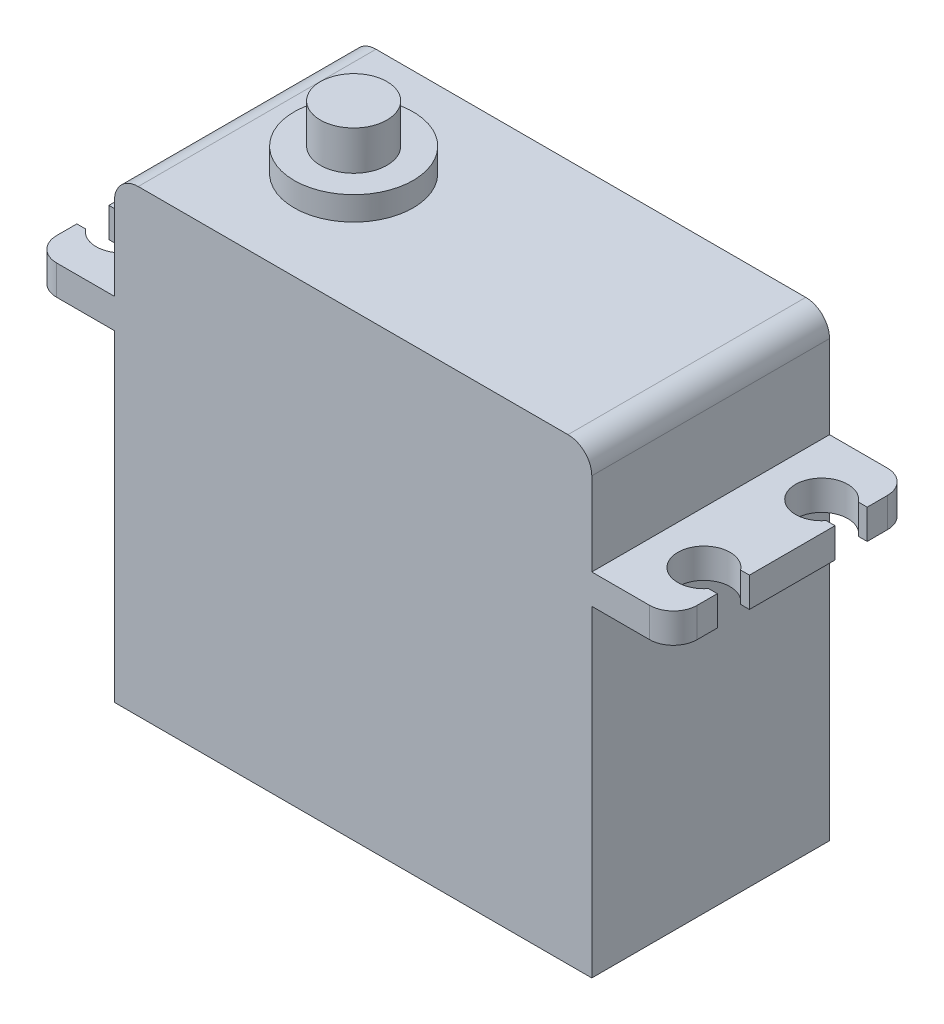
ISO-10303-21;
HEADER;
FILE_DESCRIPTION(('STEP AP214'),'2;1');
FILE_NAME('part.step','',(''),(''),'','','');
FILE_SCHEMA(('AUTOMOTIVE_DESIGN { 1 0 10303 214 1 1 1 1 }'));
ENDSEC;
DATA;
#1=APPLICATION_CONTEXT('core data for automotive mechanical design processes');
#2=APPLICATION_PROTOCOL_DEFINITION('international standard','automotive_design',2000,#1);
#3=PRODUCT_CONTEXT('',#1,'mechanical');
#4=PRODUCT('Part','Part','',(#3));
#5=PRODUCT_RELATED_PRODUCT_CATEGORY('part','',(#4));
#6=PRODUCT_DEFINITION_FORMATION('','',#4);
#7=PRODUCT_DEFINITION_CONTEXT('part definition',#1,'design');
#8=PRODUCT_DEFINITION('design','',#6,#7);
#9=PRODUCT_DEFINITION_SHAPE('','',#8);
#10=(LENGTH_UNIT() NAMED_UNIT(*) SI_UNIT(.MILLI.,.METRE.));
#11=(NAMED_UNIT(*) PLANE_ANGLE_UNIT() SI_UNIT($,.RADIAN.));
#12=(NAMED_UNIT(*) SI_UNIT($,.STERADIAN.) SOLID_ANGLE_UNIT());
#13=UNCERTAINTY_MEASURE_WITH_UNIT(LENGTH_MEASURE(1.E-05),#10,'distance_accuracy_value','');
#14=(GEOMETRIC_REPRESENTATION_CONTEXT(3) GLOBAL_UNCERTAINTY_ASSIGNED_CONTEXT((#13)) GLOBAL_UNIT_ASSIGNED_CONTEXT((#10,
#11,#12)) REPRESENTATION_CONTEXT('',''));
#15=CARTESIAN_POINT('',(0.,0.,0.));
#16=DIRECTION('',(0.,0.,1.));
#17=DIRECTION('',(1.,0.,0.));
#18=AXIS2_PLACEMENT_3D('',#15,#16,#17);
#19=CARTESIAN_POINT('',(20.066,40.5638,9.9949));
#20=DIRECTION('',(-1.,0.,0.));
#21=DIRECTION('',(0.,0.,1.));
#22=AXIS2_PLACEMENT_3D('',#19,#20,#21);
#23=PLANE('',#22);
#24=DIRECTION('',(0.,-1.,0.));
#25=VECTOR('',#24,1.);
#26=CARTESIAN_POINT('',(20.066,40.5638,-9.9949));
#27=LINE('',#26,#25);
#28=CARTESIAN_POINT('',(20.066,36.5638,-9.9949));
#29=VERTEX_POINT('',#28);
#30=CARTESIAN_POINT('',(20.066,29.5656,-9.9949));
#31=VERTEX_POINT('',#30);
#32=EDGE_CURVE('E439',#29,#31,#27,.T.);
#33=ORIENTED_EDGE('',*,*,#32,.F.);
#34=DIRECTION('',(0.,0.,-1.));
#35=VECTOR('',#34,1.);
#36=CARTESIAN_POINT('',(20.066,36.5638,9.9949));
#37=LINE('',#36,#35);
#38=CARTESIAN_POINT('',(20.066,36.5638,9.9949));
#39=VERTEX_POINT('',#38);
#40=EDGE_CURVE('E471',#29,#39,#37,.F.);
#41=ORIENTED_EDGE('',*,*,#40,.T.);
#42=DIRECTION('',(0.,-1.,0.));
#43=VECTOR('',#42,1.);
#44=CARTESIAN_POINT('',(20.066,40.5638,9.9949));
#45=LINE('',#44,#43);
#46=CARTESIAN_POINT('',(20.066,29.5656,9.9949));
#47=VERTEX_POINT('',#46);
#48=EDGE_CURVE('E429',#39,#47,#45,.T.);
#49=ORIENTED_EDGE('',*,*,#48,.T.);
#50=DIRECTION('',(0.,0.,1.));
#51=VECTOR('',#50,1.);
#52=CARTESIAN_POINT('',(20.066,29.5656,-9.9949));
#53=LINE('',#52,#51);
#54=EDGE_CURVE('E393',#31,#47,#53,.T.);
#55=ORIENTED_EDGE('',*,*,#54,.F.);
#56=EDGE_LOOP('',(#33,#41,#49,#55));
#57=FACE_BOUND('',#56,.T.);
#58=ADVANCED_FACE('F36',(#57),#23,.F.);
#59=CARTESIAN_POINT('',(-20.066,40.5638,-9.9949));
#60=DIRECTION('',(0.,0.,1.));
#61=DIRECTION('',(1.,0.,0.));
#62=AXIS2_PLACEMENT_3D('',#59,#60,#61);
#63=PLANE('',#62);
#64=DIRECTION('',(0.,-1.,0.));
#65=VECTOR('',#64,1.);
#66=CARTESIAN_POINT('',(-20.066,40.5638,-9.9949));
#67=LINE('',#66,#65);
#68=CARTESIAN_POINT('',(-20.066,36.5638,-9.9949));
#69=VERTEX_POINT('',#68);
#70=CARTESIAN_POINT('',(-20.066,29.5656,-9.9949));
#71=VERTEX_POINT('',#70);
#72=EDGE_CURVE('E435',#69,#71,#67,.T.);
#73=ORIENTED_EDGE('',*,*,#72,.F.);
#74=CARTESIAN_POINT('',(-18.066,36.5638,-9.9949));
#75=DIRECTION('',(0.,0.,1.));
#76=DIRECTION('',(1.,0.,0.));
#77=AXIS2_PLACEMENT_3D('',#74,#75,#76);
#78=CIRCLE('',#77,2.);
#79=CARTESIAN_POINT('',(-18.066,38.5638,-9.9949));
#80=VERTEX_POINT('',#79);
#81=EDGE_CURVE('E469',#69,#80,#78,.F.);
#82=ORIENTED_EDGE('',*,*,#81,.T.);
#83=DIRECTION('',(-1.,0.,0.));
#84=VECTOR('',#83,1.);
#85=CARTESIAN_POINT('',(0.,38.5638,-9.9949));
#86=LINE('',#85,#84);
#87=CARTESIAN_POINT('',(18.066,38.5638,-9.9949));
#88=VERTEX_POINT('',#87);
#89=EDGE_CURVE('E627',#88,#80,#86,.T.);
#90=ORIENTED_EDGE('',*,*,#89,.F.);
#91=CARTESIAN_POINT('',(18.066,36.5638,-9.9949));
#92=DIRECTION('',(0.,0.,1.));
#93=DIRECTION('',(1.,0.,0.));
#94=AXIS2_PLACEMENT_3D('',#91,#92,#93);
#95=CIRCLE('',#94,2.);
#96=EDGE_CURVE('E467',#88,#29,#95,.F.);
#97=ORIENTED_EDGE('',*,*,#96,.T.);
#98=ORIENTED_EDGE('',*,*,#32,.T.);
#99=DIRECTION('',(-1.,0.,0.));
#100=VECTOR('',#99,1.);
#101=CARTESIAN_POINT('',(20.066,29.5656,-9.9949));
#102=LINE('',#101,#100);
#103=CARTESIAN_POINT('',(24.924,29.5656,-9.9949));
#104=VERTEX_POINT('',#103);
#105=EDGE_CURVE('E398',#104,#31,#102,.T.);
#106=ORIENTED_EDGE('',*,*,#105,.F.);
#107=DIRECTION('',(0.,1.,0.));
#108=VECTOR('',#107,1.);
#109=CARTESIAN_POINT('',(24.924,27.0656,-9.9949));
#110=LINE('',#109,#108);
#111=CARTESIAN_POINT('',(24.924,27.0656,-9.9949));
#112=VERTEX_POINT('',#111);
#113=EDGE_CURVE('E462',#104,#112,#110,.F.);
#114=ORIENTED_EDGE('',*,*,#113,.T.);
#115=DIRECTION('',(-1.,0.,0.));
#116=VECTOR('',#115,1.);
#117=CARTESIAN_POINT('',(20.066,27.0656,-9.9949));
#118=LINE('',#117,#116);
#119=CARTESIAN_POINT('',(20.066,27.0656,-9.9949));
#120=VERTEX_POINT('',#119);
#121=EDGE_CURVE('E404',#112,#120,#118,.T.);
#122=ORIENTED_EDGE('',*,*,#121,.T.);
#123=CARTESIAN_POINT('',(20.066,0.,-9.9949));
#124=VERTEX_POINT('',#123);
#125=EDGE_CURVE('E438',#120,#124,#27,.T.);
#126=ORIENTED_EDGE('',*,*,#125,.T.);
#127=DIRECTION('',(-1.,0.,0.));
#128=VECTOR('',#127,1.);
#129=CARTESIAN_POINT('',(-20.066,0.,-9.9949));
#130=LINE('',#129,#128);
#131=CARTESIAN_POINT('',(-20.066,0.,-9.9949));
#132=VERTEX_POINT('',#131);
#133=EDGE_CURVE('E419',#124,#132,#130,.T.);
#134=ORIENTED_EDGE('',*,*,#133,.T.);
#135=CARTESIAN_POINT('',(-20.066,27.0656,-9.9949));
#136=VERTEX_POINT('',#135);
#137=EDGE_CURVE('E434',#136,#132,#67,.T.);
#138=ORIENTED_EDGE('',*,*,#137,.F.);
#139=DIRECTION('',(1.,0.,0.));
#140=VECTOR('',#139,1.);
#141=CARTESIAN_POINT('',(-20.066,27.0656,-9.9949));
#142=LINE('',#141,#140);
#143=CARTESIAN_POINT('',(-24.924,27.0656,-9.9949));
#144=VERTEX_POINT('',#143);
#145=EDGE_CURVE('E322',#144,#136,#142,.T.);
#146=ORIENTED_EDGE('',*,*,#145,.F.);
#147=DIRECTION('',(0.,1.,0.));
#148=VECTOR('',#147,1.);
#149=CARTESIAN_POINT('',(-24.924,40.5638,-9.9949));
#150=LINE('',#149,#148);
#151=CARTESIAN_POINT('',(-24.924,29.5656,-9.9949));
#152=VERTEX_POINT('',#151);
#153=EDGE_CURVE('E464',#144,#152,#150,.T.);
#154=ORIENTED_EDGE('',*,*,#153,.T.);
#155=DIRECTION('',(1.,0.,0.));
#156=VECTOR('',#155,1.);
#157=CARTESIAN_POINT('',(-20.066,29.5656,-9.9949));
#158=LINE('',#157,#156);
#159=EDGE_CURVE('E335',#152,#71,#158,.T.);
#160=ORIENTED_EDGE('',*,*,#159,.T.);
#161=EDGE_LOOP('',(#73,#82,#90,#97,#98,#106,#114,#122,#126,#134,#138,#146,#154,#160));
#162=FACE_BOUND('',#161,.T.);
#163=ADVANCED_FACE('F515',(#162),#63,.F.);
#164=CARTESIAN_POINT('',(-20.066,40.5638,9.9949));
#165=DIRECTION('',(1.,0.,0.));
#166=DIRECTION('',(0.,0.,-1.));
#167=AXIS2_PLACEMENT_3D('',#164,#165,#166);
#168=PLANE('',#167);
#169=DIRECTION('',(0.,-1.,0.));
#170=VECTOR('',#169,1.);
#171=CARTESIAN_POINT('',(-20.066,40.5638,9.9949));
#172=LINE('',#171,#170);
#173=CARTESIAN_POINT('',(-20.066,36.5638,9.9949));
#174=VERTEX_POINT('',#173);
#175=CARTESIAN_POINT('',(-20.066,29.5656,9.9949));
#176=VERTEX_POINT('',#175);
#177=EDGE_CURVE('E432',#174,#176,#172,.T.);
#178=ORIENTED_EDGE('',*,*,#177,.F.);
#179=DIRECTION('',(0.,0.,1.));
#180=VECTOR('',#179,1.);
#181=CARTESIAN_POINT('',(-20.066,36.5638,-9.9949));
#182=LINE('',#181,#180);
#183=EDGE_CURVE('E460',#174,#69,#182,.F.);
#184=ORIENTED_EDGE('',*,*,#183,.T.);
#185=ORIENTED_EDGE('',*,*,#72,.T.);
#186=DIRECTION('',(0.,0.,1.));
#187=VECTOR('',#186,1.);
#188=CARTESIAN_POINT('',(-20.066,29.5656,-9.9949));
#189=LINE('',#188,#187);
#190=EDGE_CURVE('E318',#71,#176,#189,.T.);
#191=ORIENTED_EDGE('',*,*,#190,.T.);
#192=EDGE_LOOP('',(#178,#184,#185,#191));
#193=FACE_BOUND('',#192,.T.);
#194=ADVANCED_FACE('F576',(#193),#168,.F.);
#195=CARTESIAN_POINT('',(-20.066,40.5638,9.9949));
#196=DIRECTION('',(0.,0.,-1.));
#197=DIRECTION('',(-1.,0.,0.));
#198=AXIS2_PLACEMENT_3D('',#195,#196,#197);
#199=PLANE('',#198);
#200=DIRECTION('',(1.,0.,0.));
#201=VECTOR('',#200,1.);
#202=CARTESIAN_POINT('',(0.,38.5638,9.9949));
#203=LINE('',#202,#201);
#204=CARTESIAN_POINT('',(-18.066,38.5638,9.9949));
#205=VERTEX_POINT('',#204);
#206=CARTESIAN_POINT('',(18.066,38.5638,9.9949));
#207=VERTEX_POINT('',#206);
#208=EDGE_CURVE('E634',#205,#207,#203,.T.);
#209=ORIENTED_EDGE('',*,*,#208,.F.);
#210=CARTESIAN_POINT('',(-18.066,36.5638,9.9949));
#211=DIRECTION('',(0.,0.,-1.));
#212=DIRECTION('',(-1.,0.,0.));
#213=AXIS2_PLACEMENT_3D('',#210,#211,#212);
#214=CIRCLE('',#213,2.);
#215=EDGE_CURVE('E458',#205,#174,#214,.F.);
#216=ORIENTED_EDGE('',*,*,#215,.T.);
#217=ORIENTED_EDGE('',*,*,#177,.T.);
#218=DIRECTION('',(-1.,0.,0.));
#219=VECTOR('',#218,1.);
#220=CARTESIAN_POINT('',(-20.066,29.5656,9.9949));
#221=LINE('',#220,#219);
#222=CARTESIAN_POINT('',(-24.924,29.5656,9.9949));
#223=VERTEX_POINT('',#222);
#224=EDGE_CURVE('E323',#176,#223,#221,.T.);
#225=ORIENTED_EDGE('',*,*,#224,.T.);
#226=DIRECTION('',(0.,1.,0.));
#227=VECTOR('',#226,1.);
#228=CARTESIAN_POINT('',(-24.924,40.5638,9.9949));
#229=LINE('',#228,#227);
#230=CARTESIAN_POINT('',(-24.924,27.0656,9.9949));
#231=VERTEX_POINT('',#230);
#232=EDGE_CURVE('E454',#223,#231,#229,.F.);
#233=ORIENTED_EDGE('',*,*,#232,.T.);
#234=DIRECTION('',(-1.,0.,0.));
#235=VECTOR('',#234,1.);
#236=CARTESIAN_POINT('',(-20.066,27.0656,9.9949));
#237=LINE('',#236,#235);
#238=CARTESIAN_POINT('',(-20.066,27.0656,9.9949));
#239=VERTEX_POINT('',#238);
#240=EDGE_CURVE('E328',#239,#231,#237,.T.);
#241=ORIENTED_EDGE('',*,*,#240,.F.);
#242=CARTESIAN_POINT('',(-20.066,0.,9.9949));
#243=VERTEX_POINT('',#242);
#244=EDGE_CURVE('E431',#239,#243,#172,.T.);
#245=ORIENTED_EDGE('',*,*,#244,.T.);
#246=DIRECTION('',(1.,0.,0.));
#247=VECTOR('',#246,1.);
#248=CARTESIAN_POINT('',(-20.066,0.,9.9949));
#249=LINE('',#248,#247);
#250=CARTESIAN_POINT('',(20.066,0.,9.9949));
#251=VERTEX_POINT('',#250);
#252=EDGE_CURVE('E425',#243,#251,#249,.T.);
#253=ORIENTED_EDGE('',*,*,#252,.T.);
#254=CARTESIAN_POINT('',(20.066,27.0656,9.9949));
#255=VERTEX_POINT('',#254);
#256=EDGE_CURVE('E428',#255,#251,#45,.T.);
#257=ORIENTED_EDGE('',*,*,#256,.F.);
#258=DIRECTION('',(1.,0.,0.));
#259=VECTOR('',#258,1.);
#260=CARTESIAN_POINT('',(20.066,27.0656,9.9949));
#261=LINE('',#260,#259);
#262=CARTESIAN_POINT('',(24.924,27.0656,9.9949));
#263=VERTEX_POINT('',#262);
#264=EDGE_CURVE('E397',#255,#263,#261,.T.);
#265=ORIENTED_EDGE('',*,*,#264,.T.);
#266=DIRECTION('',(0.,1.,0.));
#267=VECTOR('',#266,1.);
#268=CARTESIAN_POINT('',(24.924,29.5656,9.9949));
#269=LINE('',#268,#267);
#270=CARTESIAN_POINT('',(24.924,29.5656,9.9949));
#271=VERTEX_POINT('',#270);
#272=EDGE_CURVE('E451',#263,#271,#269,.T.);
#273=ORIENTED_EDGE('',*,*,#272,.T.);
#274=DIRECTION('',(1.,0.,0.));
#275=VECTOR('',#274,1.);
#276=CARTESIAN_POINT('',(20.066,29.5656,9.9949));
#277=LINE('',#276,#275);
#278=EDGE_CURVE('E410',#47,#271,#277,.T.);
#279=ORIENTED_EDGE('',*,*,#278,.F.);
#280=ORIENTED_EDGE('',*,*,#48,.F.);
#281=CARTESIAN_POINT('',(18.066,36.5638,9.9949));
#282=DIRECTION('',(0.,0.,-1.));
#283=DIRECTION('',(-1.,0.,0.));
#284=AXIS2_PLACEMENT_3D('',#281,#282,#283);
#285=CIRCLE('',#284,2.);
#286=EDGE_CURVE('E456',#39,#207,#285,.F.);
#287=ORIENTED_EDGE('',*,*,#286,.T.);
#288=EDGE_LOOP('',(#209,#216,#217,#225,#233,#241,#245,#253,#257,#265,#273,#279,#280,#287));
#289=FACE_BOUND('',#288,.T.);
#290=ADVANCED_FACE('F525',(#289),#199,.F.);
#291=CARTESIAN_POINT('',(-26.924,27.0656,-9.9949));
#292=DIRECTION('',(1.,0.,0.));
#293=DIRECTION('',(0.,0.,-1.));
#294=AXIS2_PLACEMENT_3D('',#291,#292,#293);
#295=PLANE('',#294);
#296=DIRECTION('',(0.,0.,-1.));
#297=VECTOR('',#296,1.);
#298=CARTESIAN_POINT('',(-26.924,29.5656,-9.9949));
#299=LINE('',#298,#297);
#300=CARTESIAN_POINT('',(-26.924,29.5656,-6.3));
#301=VERTEX_POINT('',#300);
#302=CARTESIAN_POINT('',(-26.924,29.5656,-7.9949));
#303=VERTEX_POINT('',#302);
#304=EDGE_CURVE('E281',#301,#303,#299,.T.);
#305=ORIENTED_EDGE('',*,*,#304,.T.);
#306=DIRECTION('',(0.,1.,0.));
#307=VECTOR('',#306,1.);
#308=CARTESIAN_POINT('',(-26.924,27.0656,-7.9949));
#309=LINE('',#308,#307);
#310=CARTESIAN_POINT('',(-26.924,27.0656,-7.9949));
#311=VERTEX_POINT('',#310);
#312=EDGE_CURVE('E477',#303,#311,#309,.F.);
#313=ORIENTED_EDGE('',*,*,#312,.T.);
#314=DIRECTION('',(0.,0.,-1.));
#315=VECTOR('',#314,1.);
#316=CARTESIAN_POINT('',(-26.924,27.0656,-9.9949));
#317=LINE('',#316,#315);
#318=CARTESIAN_POINT('',(-26.924,27.0656,-6.3));
#319=VERTEX_POINT('',#318);
#320=EDGE_CURVE('E325',#319,#311,#317,.T.);
#321=ORIENTED_EDGE('',*,*,#320,.F.);
#322=DIRECTION('',(0.,1.,0.));
#323=VECTOR('',#322,1.);
#324=CARTESIAN_POINT('',(-26.924,20.6463885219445,-6.3));
#325=LINE('',#324,#323);
#326=EDGE_CURVE('E264',#319,#301,#325,.T.);
#327=ORIENTED_EDGE('',*,*,#326,.T.);
#328=EDGE_LOOP('',(#305,#313,#321,#327));
#329=FACE_BOUND('',#328,.T.);
#330=ADVANCED_FACE('F608',(#329),#295,.F.);
#331=DIRECTION('',(0.,1.,0.));
#332=VECTOR('',#331,1.);
#333=CARTESIAN_POINT('',(-26.924,20.6463885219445,-3.6));
#334=LINE('',#333,#332);
#335=CARTESIAN_POINT('',(-26.924,27.0656,-3.6));
#336=VERTEX_POINT('',#335);
#337=CARTESIAN_POINT('',(-26.924,29.5656,-3.6));
#338=VERTEX_POINT('',#337);
#339=EDGE_CURVE('E287',#336,#338,#334,.T.);
#340=ORIENTED_EDGE('',*,*,#339,.F.);
#341=CARTESIAN_POINT('',(-26.924,27.0656,3.6));
#342=VERTEX_POINT('',#341);
#343=EDGE_CURVE('E329',#342,#336,#317,.T.);
#344=ORIENTED_EDGE('',*,*,#343,.F.);
#345=DIRECTION('',(0.,1.,0.));
#346=VECTOR('',#345,1.);
#347=CARTESIAN_POINT('',(-26.924,20.6463885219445,3.6));
#348=LINE('',#347,#346);
#349=CARTESIAN_POINT('',(-26.924,29.5656,3.6));
#350=VERTEX_POINT('',#349);
#351=EDGE_CURVE('E312',#342,#350,#348,.T.);
#352=ORIENTED_EDGE('',*,*,#351,.T.);
#353=EDGE_CURVE('E339',#350,#338,#299,.T.);
#354=ORIENTED_EDGE('',*,*,#353,.T.);
#355=EDGE_LOOP('',(#340,#344,#352,#354));
#356=FACE_BOUND('',#355,.T.);
#357=ADVANCED_FACE('F615',(#356),#295,.F.);
#358=CARTESIAN_POINT('',(-26.924,27.0656,7.9949));
#359=VERTEX_POINT('',#358);
#360=CARTESIAN_POINT('',(-26.924,27.0656,6.3));
#361=VERTEX_POINT('',#360);
#362=EDGE_CURVE('E326',#359,#361,#317,.T.);
#363=ORIENTED_EDGE('',*,*,#362,.F.);
#364=DIRECTION('',(0.,1.,0.));
#365=VECTOR('',#364,1.);
#366=CARTESIAN_POINT('',(-26.924,27.0656,7.9949));
#367=LINE('',#366,#365);
#368=CARTESIAN_POINT('',(-26.924,29.5656,7.9949));
#369=VERTEX_POINT('',#368);
#370=EDGE_CURVE('E483',#359,#369,#367,.T.);
#371=ORIENTED_EDGE('',*,*,#370,.T.);
#372=CARTESIAN_POINT('',(-26.924,29.5656,6.3));
#373=VERTEX_POINT('',#372);
#374=EDGE_CURVE('E337',#369,#373,#299,.T.);
#375=ORIENTED_EDGE('',*,*,#374,.T.);
#376=DIRECTION('',(0.,1.,0.));
#377=VECTOR('',#376,1.);
#378=CARTESIAN_POINT('',(-26.924,20.6463885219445,6.3));
#379=LINE('',#378,#377);
#380=EDGE_CURVE('E309',#361,#373,#379,.T.);
#381=ORIENTED_EDGE('',*,*,#380,.F.);
#382=EDGE_LOOP('',(#363,#371,#375,#381));
#383=FACE_BOUND('',#382,.T.);
#384=ADVANCED_FACE('F668',(#383),#295,.F.);
#385=DIRECTION('',(0.,0.,1.));
#386=VECTOR('',#385,1.);
#387=CARTESIAN_POINT('',(-20.066,27.0656,-9.9949));
#388=LINE('',#387,#386);
#389=EDGE_CURVE('E319',#136,#239,#388,.T.);
#390=ORIENTED_EDGE('',*,*,#389,.F.);
#391=ORIENTED_EDGE('',*,*,#137,.T.);
#392=DIRECTION('',(0.,0.,1.));
#393=VECTOR('',#392,1.);
#394=CARTESIAN_POINT('',(-20.066,0.,9.9949));
#395=LINE('',#394,#393);
#396=EDGE_CURVE('E422',#132,#243,#395,.T.);
#397=ORIENTED_EDGE('',*,*,#396,.T.);
#398=ORIENTED_EDGE('',*,*,#244,.F.);
#399=EDGE_LOOP('',(#390,#391,#397,#398));
#400=FACE_BOUND('',#399,.T.);
#401=ADVANCED_FACE('F597',(#400),#168,.F.);
#402=CARTESIAN_POINT('',(26.924,27.0656,-9.9949));
#403=DIRECTION('',(1.,0.,0.));
#404=DIRECTION('',(0.,0.,-1.));
#405=AXIS2_PLACEMENT_3D('',#402,#403,#404);
#406=PLANE('',#405);
#407=DIRECTION('',(0.,0.,-1.));
#408=VECTOR('',#407,1.);
#409=CARTESIAN_POINT('',(26.924,29.5656,-9.9949));
#410=LINE('',#409,#408);
#411=CARTESIAN_POINT('',(26.924,29.5656,7.9949));
#412=VERTEX_POINT('',#411);
#413=CARTESIAN_POINT('',(26.924,29.5656,6.3));
#414=VERTEX_POINT('',#413);
#415=EDGE_CURVE('E413',#412,#414,#410,.T.);
#416=ORIENTED_EDGE('',*,*,#415,.F.);
#417=DIRECTION('',(0.,1.,0.));
#418=VECTOR('',#417,1.);
#419=CARTESIAN_POINT('',(26.924,27.0656,7.9949));
#420=LINE('',#419,#418);
#421=CARTESIAN_POINT('',(26.924,27.0656,7.9949));
#422=VERTEX_POINT('',#421);
#423=EDGE_CURVE('E11',#412,#422,#420,.F.);
#424=ORIENTED_EDGE('',*,*,#423,.T.);
#425=DIRECTION('',(0.,0.,-1.));
#426=VECTOR('',#425,1.);
#427=CARTESIAN_POINT('',(26.924,27.0656,-9.9949));
#428=LINE('',#427,#426);
#429=CARTESIAN_POINT('',(26.924,27.0656,6.3));
#430=VERTEX_POINT('',#429);
#431=EDGE_CURVE('E402',#422,#430,#428,.T.);
#432=ORIENTED_EDGE('',*,*,#431,.T.);
#433=DIRECTION('',(0.,1.,0.));
#434=VECTOR('',#433,1.);
#435=CARTESIAN_POINT('',(26.924,20.6463885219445,6.3));
#436=LINE('',#435,#434);
#437=EDGE_CURVE('E364',#430,#414,#436,.T.);
#438=ORIENTED_EDGE('',*,*,#437,.T.);
#439=EDGE_LOOP('',(#416,#424,#432,#438));
#440=FACE_BOUND('',#439,.T.);
#441=ADVANCED_FACE('F532',(#440),#406,.T.);
#442=CARTESIAN_POINT('',(26.924,29.5656,3.6));
#443=VERTEX_POINT('',#442);
#444=CARTESIAN_POINT('',(26.924,29.5656,-3.6));
#445=VERTEX_POINT('',#444);
#446=EDGE_CURVE('E415',#443,#445,#410,.T.);
#447=ORIENTED_EDGE('',*,*,#446,.F.);
#448=DIRECTION('',(0.,1.,0.));
#449=VECTOR('',#448,1.);
#450=CARTESIAN_POINT('',(26.924,20.6463885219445,3.6));
#451=LINE('',#450,#449);
#452=CARTESIAN_POINT('',(26.924,27.0656,3.6));
#453=VERTEX_POINT('',#452);
#454=EDGE_CURVE('E362',#453,#443,#451,.T.);
#455=ORIENTED_EDGE('',*,*,#454,.F.);
#456=CARTESIAN_POINT('',(26.924,27.0656,-3.6));
#457=VERTEX_POINT('',#456);
#458=EDGE_CURVE('E405',#453,#457,#428,.T.);
#459=ORIENTED_EDGE('',*,*,#458,.T.);
#460=DIRECTION('',(0.,1.,0.));
#461=VECTOR('',#460,1.);
#462=CARTESIAN_POINT('',(26.924,20.6463885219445,-3.6));
#463=LINE('',#462,#461);
#464=EDGE_CURVE('E387',#457,#445,#463,.T.);
#465=ORIENTED_EDGE('',*,*,#464,.T.);
#466=EDGE_LOOP('',(#447,#455,#459,#465));
#467=FACE_BOUND('',#466,.T.);
#468=ADVANCED_FACE('F550',(#467),#406,.T.);
#469=CARTESIAN_POINT('',(26.924,27.0656,-6.3));
#470=VERTEX_POINT('',#469);
#471=CARTESIAN_POINT('',(26.924,27.0656,-7.9949));
#472=VERTEX_POINT('',#471);
#473=EDGE_CURVE('E401',#470,#472,#428,.T.);
#474=ORIENTED_EDGE('',*,*,#473,.T.);
#475=DIRECTION('',(0.,1.,0.));
#476=VECTOR('',#475,1.);
#477=CARTESIAN_POINT('',(26.924,29.5656,-7.9949));
#478=LINE('',#477,#476);
#479=CARTESIAN_POINT('',(26.924,29.5656,-7.9949));
#480=VERTEX_POINT('',#479);
#481=EDGE_CURVE('E486',#472,#480,#478,.T.);
#482=ORIENTED_EDGE('',*,*,#481,.T.);
#483=CARTESIAN_POINT('',(26.924,29.5656,-6.3));
#484=VERTEX_POINT('',#483);
#485=EDGE_CURVE('E412',#484,#480,#410,.T.);
#486=ORIENTED_EDGE('',*,*,#485,.F.);
#487=DIRECTION('',(0.,1.,0.));
#488=VECTOR('',#487,1.);
#489=CARTESIAN_POINT('',(26.924,20.6463885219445,-6.3));
#490=LINE('',#489,#488);
#491=EDGE_CURVE('E385',#470,#484,#490,.T.);
#492=ORIENTED_EDGE('',*,*,#491,.F.);
#493=EDGE_LOOP('',(#474,#482,#486,#492));
#494=FACE_BOUND('',#493,.T.);
#495=ADVANCED_FACE('F506',(#494),#406,.T.);
#496=ORIENTED_EDGE('',*,*,#125,.F.);
#497=DIRECTION('',(0.,0.,1.));
#498=VECTOR('',#497,1.);
#499=CARTESIAN_POINT('',(20.066,27.0656,-9.9949));
#500=LINE('',#499,#498);
#501=EDGE_CURVE('E394',#120,#255,#500,.T.);
#502=ORIENTED_EDGE('',*,*,#501,.T.);
#503=ORIENTED_EDGE('',*,*,#256,.T.);
#504=DIRECTION('',(0.,0.,-1.));
#505=VECTOR('',#504,1.);
#506=CARTESIAN_POINT('',(20.066,0.,9.9949));
#507=LINE('',#506,#505);
#508=EDGE_CURVE('E407',#251,#124,#507,.T.);
#509=ORIENTED_EDGE('',*,*,#508,.T.);
#510=EDGE_LOOP('',(#496,#502,#503,#509));
#511=FACE_BOUND('',#510,.T.);
#512=ADVANCED_FACE('F572',(#511),#23,.F.);
#513=CARTESIAN_POINT('',(0.,0.,0.));
#514=DIRECTION('',(0.,-1.,0.));
#515=DIRECTION('',(0.,0.,-1.));
#516=AXIS2_PLACEMENT_3D('',#513,#514,#515);
#517=PLANE('',#516);
#518=ORIENTED_EDGE('',*,*,#508,.F.);
#519=ORIENTED_EDGE('',*,*,#252,.F.);
#520=ORIENTED_EDGE('',*,*,#396,.F.);
#521=ORIENTED_EDGE('',*,*,#133,.F.);
#522=EDGE_LOOP('',(#518,#519,#520,#521));
#523=FACE_BOUND('',#522,.T.);
#524=ADVANCED_FACE('F580',(#523),#517,.T.);
#525=CARTESIAN_POINT('',(0.,27.0656,0.));
#526=DIRECTION('',(0.,1.,0.));
#527=DIRECTION('',(0.,0.,1.));
#528=AXIS2_PLACEMENT_3D('',#525,#526,#527);
#529=PLANE('',#528);
#530=ORIENTED_EDGE('',*,*,#121,.F.);
#531=CARTESIAN_POINT('',(24.924,27.0656,-7.9949));
#532=DIRECTION('',(0.,1.,0.));
#533=DIRECTION('',(0.,0.,1.));
#534=AXIS2_PLACEMENT_3D('',#531,#532,#533);
#535=CIRCLE('',#534,2.);
#536=EDGE_CURVE('E44',#112,#472,#535,.F.);
#537=ORIENTED_EDGE('',*,*,#536,.T.);
#538=ORIENTED_EDGE('',*,*,#473,.F.);
#539=DIRECTION('',(1.,0.,0.));
#540=VECTOR('',#539,1.);
#541=CARTESIAN_POINT('',(26.187095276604,27.0656,-6.3));
#542=LINE('',#541,#540);
#543=CARTESIAN_POINT('',(26.187095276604,27.0656,-6.3));
#544=VERTEX_POINT('',#543);
#545=EDGE_CURVE('E370',#544,#470,#542,.T.);
#546=ORIENTED_EDGE('',*,*,#545,.F.);
#547=CARTESIAN_POINT('',(24.45,27.0656,-4.95));
#548=DIRECTION('',(0.,1.,0.));
#549=DIRECTION('',(0.,0.,1.));
#550=AXIS2_PLACEMENT_3D('',#547,#548,#549);
#551=CIRCLE('',#550,2.2);
#552=CARTESIAN_POINT('',(26.187095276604,27.0656,-3.6));
#553=VERTEX_POINT('',#552);
#554=EDGE_CURVE('E372',#553,#544,#551,.F.);
#555=ORIENTED_EDGE('',*,*,#554,.F.);
#556=DIRECTION('',(-1.,0.,0.));
#557=VECTOR('',#556,1.);
#558=CARTESIAN_POINT('',(26.187095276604,27.0656,-3.6));
#559=LINE('',#558,#557);
#560=EDGE_CURVE('E375',#457,#553,#559,.T.);
#561=ORIENTED_EDGE('',*,*,#560,.F.);
#562=ORIENTED_EDGE('',*,*,#458,.F.);
#563=DIRECTION('',(-1.,0.,0.));
#564=VECTOR('',#563,1.);
#565=CARTESIAN_POINT('',(26.187095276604,27.0656,3.6));
#566=LINE('',#565,#564);
#567=CARTESIAN_POINT('',(26.187095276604,27.0656,3.6));
#568=VERTEX_POINT('',#567);
#569=EDGE_CURVE('E342',#453,#568,#566,.T.);
#570=ORIENTED_EDGE('',*,*,#569,.T.);
#571=CARTESIAN_POINT('',(24.45,27.0656,4.95));
#572=DIRECTION('',(0.,1.,0.));
#573=DIRECTION('',(0.,0.,1.));
#574=AXIS2_PLACEMENT_3D('',#571,#572,#573);
#575=CIRCLE('',#574,2.2);
#576=CARTESIAN_POINT('',(26.187095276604,27.0656,6.3));
#577=VERTEX_POINT('',#576);
#578=EDGE_CURVE('E345',#568,#577,#575,.T.);
#579=ORIENTED_EDGE('',*,*,#578,.T.);
#580=DIRECTION('',(1.,0.,0.));
#581=VECTOR('',#580,1.);
#582=CARTESIAN_POINT('',(26.187095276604,27.0656,6.3));
#583=LINE('',#582,#581);
#584=EDGE_CURVE('E346',#577,#430,#583,.T.);
#585=ORIENTED_EDGE('',*,*,#584,.T.);
#586=ORIENTED_EDGE('',*,*,#431,.F.);
#587=CARTESIAN_POINT('',(24.924,27.0656,7.9949));
#588=DIRECTION('',(0.,1.,0.));
#589=DIRECTION('',(0.,0.,1.));
#590=AXIS2_PLACEMENT_3D('',#587,#588,#589);
#591=CIRCLE('',#590,2.);
#592=EDGE_CURVE('E492',#422,#263,#591,.F.);
#593=ORIENTED_EDGE('',*,*,#592,.T.);
#594=ORIENTED_EDGE('',*,*,#264,.F.);
#595=ORIENTED_EDGE('',*,*,#501,.F.);
#596=EDGE_LOOP('',(#530,#537,#538,#546,#555,#561,#562,#570,#579,#585,#586,#593,#594,#595));
#597=FACE_BOUND('',#596,.T.);
#598=ADVANCED_FACE('F498',(#597),#529,.F.);
#599=CARTESIAN_POINT('',(0.,29.5656,0.));
#600=DIRECTION('',(0.,1.,0.));
#601=DIRECTION('',(0.,0.,1.));
#602=AXIS2_PLACEMENT_3D('',#599,#600,#601);
#603=PLANE('',#602);
#604=ORIENTED_EDGE('',*,*,#485,.T.);
#605=CARTESIAN_POINT('',(24.924,29.5656,-7.9949));
#606=DIRECTION('',(0.,1.,0.));
#607=DIRECTION('',(0.,0.,1.));
#608=AXIS2_PLACEMENT_3D('',#605,#606,#607);
#609=CIRCLE('',#608,2.);
#610=EDGE_CURVE('E490',#480,#104,#609,.T.);
#611=ORIENTED_EDGE('',*,*,#610,.T.);
#612=ORIENTED_EDGE('',*,*,#105,.T.);
#613=ORIENTED_EDGE('',*,*,#54,.T.);
#614=ORIENTED_EDGE('',*,*,#278,.T.);
#615=CARTESIAN_POINT('',(24.924,29.5656,7.9949));
#616=DIRECTION('',(0.,1.,0.));
#617=DIRECTION('',(0.,0.,1.));
#618=AXIS2_PLACEMENT_3D('',#615,#616,#617);
#619=CIRCLE('',#618,2.);
#620=EDGE_CURVE('E57',#271,#412,#619,.T.);
#621=ORIENTED_EDGE('',*,*,#620,.T.);
#622=ORIENTED_EDGE('',*,*,#415,.T.);
#623=DIRECTION('',(-1.,0.,0.));
#624=VECTOR('',#623,1.);
#625=CARTESIAN_POINT('',(26.187095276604,29.5656,6.3));
#626=LINE('',#625,#624);
#627=CARTESIAN_POINT('',(26.187095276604,29.5656,6.3));
#628=VERTEX_POINT('',#627);
#629=EDGE_CURVE('E352',#414,#628,#626,.T.);
#630=ORIENTED_EDGE('',*,*,#629,.T.);
#631=CARTESIAN_POINT('',(24.45,29.5656,4.95));
#632=DIRECTION('',(0.,-1.,0.));
#633=DIRECTION('',(0.,0.,-1.));
#634=AXIS2_PLACEMENT_3D('',#631,#632,#633);
#635=CIRCLE('',#634,2.2);
#636=CARTESIAN_POINT('',(26.187095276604,29.5656,3.6));
#637=VERTEX_POINT('',#636);
#638=EDGE_CURVE('E332',#628,#637,#635,.T.);
#639=ORIENTED_EDGE('',*,*,#638,.T.);
#640=DIRECTION('',(1.,0.,0.));
#641=VECTOR('',#640,1.);
#642=CARTESIAN_POINT('',(26.187095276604,29.5656,3.6));
#643=LINE('',#642,#641);
#644=EDGE_CURVE('E355',#637,#443,#643,.T.);
#645=ORIENTED_EDGE('',*,*,#644,.T.);
#646=ORIENTED_EDGE('',*,*,#446,.T.);
#647=DIRECTION('',(1.,0.,0.));
#648=VECTOR('',#647,1.);
#649=CARTESIAN_POINT('',(26.187095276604,29.5656,-3.6));
#650=LINE('',#649,#648);
#651=CARTESIAN_POINT('',(26.187095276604,29.5656,-3.6));
#652=VERTEX_POINT('',#651);
#653=EDGE_CURVE('E377',#652,#445,#650,.T.);
#654=ORIENTED_EDGE('',*,*,#653,.F.);
#655=CARTESIAN_POINT('',(24.45,29.5656,-4.95));
#656=DIRECTION('',(0.,1.,0.));
#657=DIRECTION('',(0.,0.,1.));
#658=AXIS2_PLACEMENT_3D('',#655,#656,#657);
#659=CIRCLE('',#658,2.2);
#660=CARTESIAN_POINT('',(26.187095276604,29.5656,-6.3));
#661=VERTEX_POINT('',#660);
#662=EDGE_CURVE('E349',#661,#652,#659,.T.);
#663=ORIENTED_EDGE('',*,*,#662,.F.);
#664=DIRECTION('',(-1.,0.,0.));
#665=VECTOR('',#664,1.);
#666=CARTESIAN_POINT('',(26.187095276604,29.5656,-6.3));
#667=LINE('',#666,#665);
#668=EDGE_CURVE('E380',#484,#661,#667,.T.);
#669=ORIENTED_EDGE('',*,*,#668,.F.);
#670=EDGE_LOOP('',(#604,#611,#612,#613,#614,#621,#622,#630,#639,#645,#646,#654,#663,#669));
#671=FACE_BOUND('',#670,.T.);
#672=ADVANCED_FACE('F511',(#671),#603,.T.);
#673=CARTESIAN_POINT('',(24.45,20.6463885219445,-4.95));
#674=DIRECTION('',(0.,1.,0.));
#675=DIRECTION('',(0.,0.,1.));
#676=AXIS2_PLACEMENT_3D('',#673,#674,#675);
#677=CYLINDRICAL_SURFACE('',#676,2.2);
#678=ORIENTED_EDGE('',*,*,#554,.T.);
#679=DIRECTION('',(0.,1.,0.));
#680=VECTOR('',#679,1.);
#681=CARTESIAN_POINT('',(26.187095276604,20.6463885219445,-6.3));
#682=LINE('',#681,#680);
#683=EDGE_CURVE('E373',#544,#661,#682,.T.);
#684=ORIENTED_EDGE('',*,*,#683,.T.);
#685=ORIENTED_EDGE('',*,*,#662,.T.);
#686=DIRECTION('',(0.,1.,0.));
#687=VECTOR('',#686,1.);
#688=CARTESIAN_POINT('',(26.187095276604,20.6463885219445,-3.6));
#689=LINE('',#688,#687);
#690=EDGE_CURVE('E383',#553,#652,#689,.T.);
#691=ORIENTED_EDGE('',*,*,#690,.F.);
#692=EDGE_LOOP('',(#678,#684,#685,#691));
#693=FACE_BOUND('',#692,.T.);
#694=ADVANCED_FACE('F557',(#693),#677,.F.);
#695=CARTESIAN_POINT('',(26.187095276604,20.6463885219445,-6.3));
#696=DIRECTION('',(0.,0.,-1.));
#697=DIRECTION('',(-1.,0.,0.));
#698=AXIS2_PLACEMENT_3D('',#695,#696,#697);
#699=PLANE('',#698);
#700=ORIENTED_EDGE('',*,*,#545,.T.);
#701=ORIENTED_EDGE('',*,*,#491,.T.);
#702=ORIENTED_EDGE('',*,*,#668,.T.);
#703=ORIENTED_EDGE('',*,*,#683,.F.);
#704=EDGE_LOOP('',(#700,#701,#702,#703));
#705=FACE_BOUND('',#704,.T.);
#706=ADVANCED_FACE('F560',(#705),#699,.F.);
#707=CARTESIAN_POINT('',(26.187095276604,20.6463885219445,-3.6));
#708=DIRECTION('',(0.,0.,1.));
#709=DIRECTION('',(1.,0.,0.));
#710=AXIS2_PLACEMENT_3D('',#707,#708,#709);
#711=PLANE('',#710);
#712=ORIENTED_EDGE('',*,*,#560,.T.);
#713=ORIENTED_EDGE('',*,*,#690,.T.);
#714=ORIENTED_EDGE('',*,*,#653,.T.);
#715=ORIENTED_EDGE('',*,*,#464,.F.);
#716=EDGE_LOOP('',(#712,#713,#714,#715));
#717=FACE_BOUND('',#716,.T.);
#718=ADVANCED_FACE('F552',(#717),#711,.F.);
#719=CARTESIAN_POINT('',(26.187095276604,20.6463885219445,6.3));
#720=DIRECTION('',(0.,0.,-1.));
#721=DIRECTION('',(-1.,0.,0.));
#722=AXIS2_PLACEMENT_3D('',#719,#720,#721);
#723=PLANE('',#722);
#724=DIRECTION('',(0.,1.,0.));
#725=VECTOR('',#724,1.);
#726=CARTESIAN_POINT('',(26.187095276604,20.6463885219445,6.3));
#727=LINE('',#726,#725);
#728=EDGE_CURVE('E358',#577,#628,#727,.T.);
#729=ORIENTED_EDGE('',*,*,#728,.T.);
#730=ORIENTED_EDGE('',*,*,#629,.F.);
#731=ORIENTED_EDGE('',*,*,#437,.F.);
#732=ORIENTED_EDGE('',*,*,#584,.F.);
#733=EDGE_LOOP('',(#729,#730,#731,#732));
#734=FACE_BOUND('',#733,.T.);
#735=ADVANCED_FACE('F535',(#734),#723,.T.);
#736=CARTESIAN_POINT('',(26.187095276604,20.6463885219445,3.6));
#737=DIRECTION('',(0.,0.,1.));
#738=DIRECTION('',(1.,0.,0.));
#739=AXIS2_PLACEMENT_3D('',#736,#737,#738);
#740=PLANE('',#739);
#741=ORIENTED_EDGE('',*,*,#454,.T.);
#742=ORIENTED_EDGE('',*,*,#644,.F.);
#743=DIRECTION('',(0.,1.,0.));
#744=VECTOR('',#743,1.);
#745=CARTESIAN_POINT('',(26.187095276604,20.6463885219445,3.6));
#746=LINE('',#745,#744);
#747=EDGE_CURVE('E359',#568,#637,#746,.T.);
#748=ORIENTED_EDGE('',*,*,#747,.F.);
#749=ORIENTED_EDGE('',*,*,#569,.F.);
#750=EDGE_LOOP('',(#741,#742,#748,#749));
#751=FACE_BOUND('',#750,.T.);
#752=ADVANCED_FACE('F543',(#751),#740,.T.);
#753=CARTESIAN_POINT('',(24.45,20.6463885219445,4.95));
#754=DIRECTION('',(0.,1.,0.));
#755=DIRECTION('',(0.,0.,1.));
#756=AXIS2_PLACEMENT_3D('',#753,#754,#755);
#757=CYLINDRICAL_SURFACE('',#756,2.2);
#758=ORIENTED_EDGE('',*,*,#747,.T.);
#759=ORIENTED_EDGE('',*,*,#638,.F.);
#760=ORIENTED_EDGE('',*,*,#728,.F.);
#761=ORIENTED_EDGE('',*,*,#578,.F.);
#762=EDGE_LOOP('',(#758,#759,#760,#761));
#763=FACE_BOUND('',#762,.T.);
#764=ADVANCED_FACE('F540',(#763),#757,.F.);
#765=CARTESIAN_POINT('',(0.,27.0656,0.));
#766=DIRECTION('',(0.,1.,0.));
#767=DIRECTION('',(0.,0.,1.));
#768=AXIS2_PLACEMENT_3D('',#765,#766,#767);
#769=PLANE('',#768);
#770=ORIENTED_EDGE('',*,*,#320,.T.);
#771=CARTESIAN_POINT('',(-24.924,27.0656,-7.9949));
#772=DIRECTION('',(0.,1.,0.));
#773=DIRECTION('',(0.,0.,1.));
#774=AXIS2_PLACEMENT_3D('',#771,#772,#773);
#775=CIRCLE('',#774,2.);
#776=EDGE_CURVE('E481',#311,#144,#775,.F.);
#777=ORIENTED_EDGE('',*,*,#776,.T.);
#778=ORIENTED_EDGE('',*,*,#145,.T.);
#779=ORIENTED_EDGE('',*,*,#389,.T.);
#780=ORIENTED_EDGE('',*,*,#240,.T.);
#781=CARTESIAN_POINT('',(-24.924,27.0656,7.9949));
#782=DIRECTION('',(0.,1.,0.));
#783=DIRECTION('',(0.,0.,1.));
#784=AXIS2_PLACEMENT_3D('',#781,#782,#783);
#785=CIRCLE('',#784,2.);
#786=EDGE_CURVE('E479',#231,#359,#785,.F.);
#787=ORIENTED_EDGE('',*,*,#786,.T.);
#788=ORIENTED_EDGE('',*,*,#362,.T.);
#789=DIRECTION('',(-1.,0.,0.));
#790=VECTOR('',#789,1.);
#791=CARTESIAN_POINT('',(-26.187095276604,27.0656,6.3));
#792=LINE('',#791,#790);
#793=CARTESIAN_POINT('',(-26.187095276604,27.0656,6.3));
#794=VERTEX_POINT('',#793);
#795=EDGE_CURVE('E292',#794,#361,#792,.T.);
#796=ORIENTED_EDGE('',*,*,#795,.F.);
#797=CARTESIAN_POINT('',(-24.45,27.0656,4.95));
#798=DIRECTION('',(0.,1.,0.));
#799=DIRECTION('',(0.,0.,1.));
#800=AXIS2_PLACEMENT_3D('',#797,#798,#799);
#801=CIRCLE('',#800,2.2);
#802=CARTESIAN_POINT('',(-26.187095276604,27.0656,3.6));
#803=VERTEX_POINT('',#802);
#804=EDGE_CURVE('E295',#803,#794,#801,.F.);
#805=ORIENTED_EDGE('',*,*,#804,.F.);
#806=DIRECTION('',(1.,0.,0.));
#807=VECTOR('',#806,1.);
#808=CARTESIAN_POINT('',(-26.187095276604,27.0656,3.6));
#809=LINE('',#808,#807);
#810=EDGE_CURVE('E298',#342,#803,#809,.T.);
#811=ORIENTED_EDGE('',*,*,#810,.F.);
#812=ORIENTED_EDGE('',*,*,#343,.T.);
#813=DIRECTION('',(1.,0.,0.));
#814=VECTOR('',#813,1.);
#815=CARTESIAN_POINT('',(-26.187095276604,27.0656,-3.6));
#816=LINE('',#815,#814);
#817=CARTESIAN_POINT('',(-26.187095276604,27.0656,-3.6));
#818=VERTEX_POINT('',#817);
#819=EDGE_CURVE('E291',#336,#818,#816,.T.);
#820=ORIENTED_EDGE('',*,*,#819,.T.);
#821=CARTESIAN_POINT('',(-24.45,27.0656,-4.95));
#822=DIRECTION('',(0.,1.,0.));
#823=DIRECTION('',(0.,0.,1.));
#824=AXIS2_PLACEMENT_3D('',#821,#822,#823);
#825=CIRCLE('',#824,2.2);
#826=CARTESIAN_POINT('',(-26.187095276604,27.0656,-6.3));
#827=VERTEX_POINT('',#826);
#828=EDGE_CURVE('E302',#818,#827,#825,.T.);
#829=ORIENTED_EDGE('',*,*,#828,.T.);
#830=DIRECTION('',(-1.,0.,0.));
#831=VECTOR('',#830,1.);
#832=CARTESIAN_POINT('',(-26.187095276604,27.0656,-6.3));
#833=LINE('',#832,#831);
#834=EDGE_CURVE('E261',#827,#319,#833,.T.);
#835=ORIENTED_EDGE('',*,*,#834,.T.);
#836=EDGE_LOOP('',(#770,#777,#778,#779,#780,#787,#788,#796,#805,#811,#812,#820,#829,#835));
#837=FACE_BOUND('',#836,.T.);
#838=ADVANCED_FACE('F664',(#837),#769,.F.);
#839=CARTESIAN_POINT('',(0.,29.5656,0.));
#840=DIRECTION('',(0.,1.,0.));
#841=DIRECTION('',(0.,0.,1.));
#842=AXIS2_PLACEMENT_3D('',#839,#840,#841);
#843=PLANE('',#842);
#844=ORIENTED_EDGE('',*,*,#159,.F.);
#845=CARTESIAN_POINT('',(-24.924,29.5656,-7.9949));
#846=DIRECTION('',(0.,1.,0.));
#847=DIRECTION('',(0.,0.,1.));
#848=AXIS2_PLACEMENT_3D('',#845,#846,#847);
#849=CIRCLE('',#848,2.);
#850=EDGE_CURVE('E475',#152,#303,#849,.T.);
#851=ORIENTED_EDGE('',*,*,#850,.T.);
#852=ORIENTED_EDGE('',*,*,#304,.F.);
#853=DIRECTION('',(1.,0.,0.));
#854=VECTOR('',#853,1.);
#855=CARTESIAN_POINT('',(-26.187095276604,29.5656,-6.3));
#856=LINE('',#855,#854);
#857=CARTESIAN_POINT('',(-26.187095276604,29.5656,-6.3));
#858=VERTEX_POINT('',#857);
#859=EDGE_CURVE('E258',#301,#858,#856,.T.);
#860=ORIENTED_EDGE('',*,*,#859,.T.);
#861=CARTESIAN_POINT('',(-24.45,29.5656,-4.95));
#862=DIRECTION('',(0.,-1.,0.));
#863=DIRECTION('',(0.,0.,1.));
#864=AXIS2_PLACEMENT_3D('',#861,#862,#863);
#865=CIRCLE('',#864,2.2);
#866=CARTESIAN_POINT('',(-26.187095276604,29.5656,-3.6));
#867=VERTEX_POINT('',#866);
#868=EDGE_CURVE('E269',#858,#867,#865,.T.);
#869=ORIENTED_EDGE('',*,*,#868,.T.);
#870=DIRECTION('',(-1.,0.,0.));
#871=VECTOR('',#870,1.);
#872=CARTESIAN_POINT('',(-26.187095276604,29.5656,-3.6));
#873=LINE('',#872,#871);
#874=EDGE_CURVE('E265',#867,#338,#873,.T.);
#875=ORIENTED_EDGE('',*,*,#874,.T.);
#876=ORIENTED_EDGE('',*,*,#353,.F.);
#877=DIRECTION('',(-1.,0.,0.));
#878=VECTOR('',#877,1.);
#879=CARTESIAN_POINT('',(-26.187095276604,29.5656,3.6));
#880=LINE('',#879,#878);
#881=CARTESIAN_POINT('',(-26.187095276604,29.5656,3.6));
#882=VERTEX_POINT('',#881);
#883=EDGE_CURVE('E301',#882,#350,#880,.T.);
#884=ORIENTED_EDGE('',*,*,#883,.F.);
#885=CARTESIAN_POINT('',(-24.45,29.5656,4.95));
#886=DIRECTION('',(0.,1.,0.));
#887=DIRECTION('',(0.,0.,-1.));
#888=AXIS2_PLACEMENT_3D('',#885,#886,#887);
#889=CIRCLE('',#888,2.2);
#890=CARTESIAN_POINT('',(-26.187095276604,29.5656,6.3));
#891=VERTEX_POINT('',#890);
#892=EDGE_CURVE('E299',#891,#882,#889,.T.);
#893=ORIENTED_EDGE('',*,*,#892,.F.);
#894=DIRECTION('',(1.,0.,0.));
#895=VECTOR('',#894,1.);
#896=CARTESIAN_POINT('',(-26.187095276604,29.5656,6.3));
#897=LINE('',#896,#895);
#898=EDGE_CURVE('E304',#373,#891,#897,.T.);
#899=ORIENTED_EDGE('',*,*,#898,.F.);
#900=ORIENTED_EDGE('',*,*,#374,.F.);
#901=CARTESIAN_POINT('',(-24.924,29.5656,7.9949));
#902=DIRECTION('',(0.,1.,0.));
#903=DIRECTION('',(0.,0.,1.));
#904=AXIS2_PLACEMENT_3D('',#901,#902,#903);
#905=CIRCLE('',#904,2.);
#906=EDGE_CURVE('E473',#369,#223,#905,.T.);
#907=ORIENTED_EDGE('',*,*,#906,.T.);
#908=ORIENTED_EDGE('',*,*,#224,.F.);
#909=ORIENTED_EDGE('',*,*,#190,.F.);
#910=EDGE_LOOP('',(#844,#851,#852,#860,#869,#875,#876,#884,#893,#899,#900,#907,#908,#909));
#911=FACE_BOUND('',#910,.T.);
#912=ADVANCED_FACE('F279',(#911),#843,.T.);
#913=CARTESIAN_POINT('',(-24.45,20.6463885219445,4.95));
#914=DIRECTION('',(0.,1.,0.));
#915=DIRECTION('',(0.,0.,1.));
#916=AXIS2_PLACEMENT_3D('',#913,#914,#915);
#917=CYLINDRICAL_SURFACE('',#916,2.2);
#918=ORIENTED_EDGE('',*,*,#804,.T.);
#919=DIRECTION('',(0.,1.,0.));
#920=VECTOR('',#919,1.);
#921=CARTESIAN_POINT('',(-26.187095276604,20.6463885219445,6.3));
#922=LINE('',#921,#920);
#923=EDGE_CURVE('E296',#794,#891,#922,.T.);
#924=ORIENTED_EDGE('',*,*,#923,.T.);
#925=ORIENTED_EDGE('',*,*,#892,.T.);
#926=DIRECTION('',(0.,1.,0.));
#927=VECTOR('',#926,1.);
#928=CARTESIAN_POINT('',(-26.187095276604,20.6463885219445,3.6));
#929=LINE('',#928,#927);
#930=EDGE_CURVE('E307',#803,#882,#929,.T.);
#931=ORIENTED_EDGE('',*,*,#930,.F.);
#932=EDGE_LOOP('',(#918,#924,#925,#931));
#933=FACE_BOUND('',#932,.T.);
#934=ADVANCED_FACE('F675',(#933),#917,.F.);
#935=CARTESIAN_POINT('',(-26.187095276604,20.6463885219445,6.3));
#936=DIRECTION('',(0.,0.,1.));
#937=DIRECTION('',(1.,0.,0.));
#938=AXIS2_PLACEMENT_3D('',#935,#936,#937);
#939=PLANE('',#938);
#940=ORIENTED_EDGE('',*,*,#795,.T.);
#941=ORIENTED_EDGE('',*,*,#380,.T.);
#942=ORIENTED_EDGE('',*,*,#898,.T.);
#943=ORIENTED_EDGE('',*,*,#923,.F.);
#944=EDGE_LOOP('',(#940,#941,#942,#943));
#945=FACE_BOUND('',#944,.T.);
#946=ADVANCED_FACE('F671',(#945),#939,.F.);
#947=CARTESIAN_POINT('',(-26.187095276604,20.6463885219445,3.6));
#948=DIRECTION('',(0.,0.,-1.));
#949=DIRECTION('',(-1.,0.,0.));
#950=AXIS2_PLACEMENT_3D('',#947,#948,#949);
#951=PLANE('',#950);
#952=ORIENTED_EDGE('',*,*,#810,.T.);
#953=ORIENTED_EDGE('',*,*,#930,.T.);
#954=ORIENTED_EDGE('',*,*,#883,.T.);
#955=ORIENTED_EDGE('',*,*,#351,.F.);
#956=EDGE_LOOP('',(#952,#953,#954,#955));
#957=FACE_BOUND('',#956,.T.);
#958=ADVANCED_FACE('F678',(#957),#951,.F.);
#959=CARTESIAN_POINT('',(-26.187095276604,20.6463885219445,-6.3));
#960=DIRECTION('',(0.,0.,1.));
#961=DIRECTION('',(1.,0.,0.));
#962=AXIS2_PLACEMENT_3D('',#959,#960,#961);
#963=PLANE('',#962);
#964=DIRECTION('',(0.,1.,0.));
#965=VECTOR('',#964,1.);
#966=CARTESIAN_POINT('',(-26.187095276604,20.6463885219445,-6.3));
#967=LINE('',#966,#965);
#968=EDGE_CURVE('E254',#827,#858,#967,.T.);
#969=ORIENTED_EDGE('',*,*,#968,.T.);
#970=ORIENTED_EDGE('',*,*,#859,.F.);
#971=ORIENTED_EDGE('',*,*,#326,.F.);
#972=ORIENTED_EDGE('',*,*,#834,.F.);
#973=EDGE_LOOP('',(#969,#970,#971,#972));
#974=FACE_BOUND('',#973,.T.);
#975=ADVANCED_FACE('F256',(#974),#963,.T.);
#976=CARTESIAN_POINT('',(-26.187095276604,20.6463885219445,-3.6));
#977=DIRECTION('',(0.,0.,-1.));
#978=DIRECTION('',(-1.,0.,0.));
#979=AXIS2_PLACEMENT_3D('',#976,#977,#978);
#980=PLANE('',#979);
#981=ORIENTED_EDGE('',*,*,#339,.T.);
#982=ORIENTED_EDGE('',*,*,#874,.F.);
#983=DIRECTION('',(0.,1.,0.));
#984=VECTOR('',#983,1.);
#985=CARTESIAN_POINT('',(-26.187095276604,20.6463885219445,-3.6));
#986=LINE('',#985,#984);
#987=EDGE_CURVE('E272',#818,#867,#986,.T.);
#988=ORIENTED_EDGE('',*,*,#987,.F.);
#989=ORIENTED_EDGE('',*,*,#819,.F.);
#990=EDGE_LOOP('',(#981,#982,#988,#989));
#991=FACE_BOUND('',#990,.T.);
#992=ADVANCED_FACE('F621',(#991),#980,.T.);
#993=CARTESIAN_POINT('',(-24.45,20.6463885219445,-4.95));
#994=DIRECTION('',(0.,1.,0.));
#995=DIRECTION('',(0.,0.,1.));
#996=AXIS2_PLACEMENT_3D('',#993,#994,#995);
#997=CYLINDRICAL_SURFACE('',#996,2.2);
#998=ORIENTED_EDGE('',*,*,#987,.T.);
#999=ORIENTED_EDGE('',*,*,#868,.F.);
#1000=ORIENTED_EDGE('',*,*,#968,.F.);
#1001=ORIENTED_EDGE('',*,*,#828,.F.);
#1002=EDGE_LOOP('',(#998,#999,#1000,#1001));
#1003=FACE_BOUND('',#1002,.T.);
#1004=ADVANCED_FACE('F270',(#1003),#997,.F.);
#1005=CARTESIAN_POINT('',(-9.95,38.5638,0.));
#1006=DIRECTION('',(0.,1.,0.));
#1007=DIRECTION('',(0.,0.,1.));
#1008=AXIS2_PLACEMENT_3D('',#1005,#1006,#1007);
#1009=CYLINDRICAL_SURFACE('',#1008,5.);
#1010=CARTESIAN_POINT('',(-9.95,38.5638,0.));
#1011=DIRECTION('',(0.,1.,0.));
#1012=DIRECTION('',(0.,0.,1.));
#1013=AXIS2_PLACEMENT_3D('',#1010,#1011,#1012);
#1014=CIRCLE('',#1013,5.);
#1015=CARTESIAN_POINT('',(-9.95,38.5638,5.));
#1016=VERTEX_POINT('',#1015);
#1017=EDGE_CURVE('E631',#1016,#1016,#1014,.T.);
#1018=ORIENTED_EDGE('',*,*,#1017,.T.);
#1019=EDGE_LOOP('',(#1018));
#1020=FACE_BOUND('',#1019,.T.);
#1021=CARTESIAN_POINT('',(-9.95,40.5638,0.));
#1022=DIRECTION('',(0.,1.,0.));
#1023=DIRECTION('',(0.,0.,1.));
#1024=AXIS2_PLACEMENT_3D('',#1021,#1022,#1023);
#1025=CIRCLE('',#1024,5.);
#1026=CARTESIAN_POINT('',(-9.95,40.5638,5.));
#1027=VERTEX_POINT('',#1026);
#1028=EDGE_CURVE('E628',#1027,#1027,#1025,.T.);
#1029=ORIENTED_EDGE('',*,*,#1028,.F.);
#1030=EDGE_LOOP('',(#1029));
#1031=FACE_BOUND('',#1030,.T.);
#1032=ADVANCED_FACE('F640',(#1020,#1031),#1009,.T.);
#1033=CARTESIAN_POINT('',(0.,38.5638,0.));
#1034=DIRECTION('',(0.,1.,0.));
#1035=DIRECTION('',(0.,0.,1.));
#1036=AXIS2_PLACEMENT_3D('',#1033,#1034,#1035);
#1037=PLANE('',#1036);
#1038=ORIENTED_EDGE('',*,*,#1017,.F.);
#1039=EDGE_LOOP('',(#1038));
#1040=FACE_BOUND('',#1039,.T.);
#1041=ORIENTED_EDGE('',*,*,#89,.T.);
#1042=DIRECTION('',(0.,0.,1.));
#1043=VECTOR('',#1042,1.);
#1044=CARTESIAN_POINT('',(-18.066,38.5638,9.9949));
#1045=LINE('',#1044,#1043);
#1046=EDGE_CURVE('E448',#80,#205,#1045,.T.);
#1047=ORIENTED_EDGE('',*,*,#1046,.T.);
#1048=ORIENTED_EDGE('',*,*,#208,.T.);
#1049=DIRECTION('',(0.,0.,-1.));
#1050=VECTOR('',#1049,1.);
#1051=CARTESIAN_POINT('',(18.066,38.5638,-9.9949));
#1052=LINE('',#1051,#1050);
#1053=EDGE_CURVE('E445',#207,#88,#1052,.T.);
#1054=ORIENTED_EDGE('',*,*,#1053,.T.);
#1055=EDGE_LOOP('',(#1041,#1047,#1048,#1054));
#1056=FACE_BOUND('',#1055,.T.);
#1057=ADVANCED_FACE('F643',(#1040,#1056),#1037,.T.);
#1058=CARTESIAN_POINT('',(-9.95,43.8638,0.));
#1059=DIRECTION('',(0.,1.,0.));
#1060=DIRECTION('',(0.,0.,1.));
#1061=AXIS2_PLACEMENT_3D('',#1058,#1059,#1060);
#1062=PLANE('',#1061);
#1063=CARTESIAN_POINT('',(-9.95,43.8638,0.));
#1064=DIRECTION('',(0.,1.,0.));
#1065=DIRECTION('',(0.,0.,1.));
#1066=AXIS2_PLACEMENT_3D('',#1063,#1064,#1065);
#1067=CIRCLE('',#1066,2.8);
#1068=CARTESIAN_POINT('',(-9.95,43.8638,2.8));
#1069=VERTEX_POINT('',#1068);
#1070=EDGE_CURVE('E275',#1069,#1069,#1067,.T.);
#1071=ORIENTED_EDGE('',*,*,#1070,.T.);
#1072=EDGE_LOOP('',(#1071));
#1073=FACE_BOUND('',#1072,.T.);
#1074=ADVANCED_FACE('F646',(#1073),#1062,.T.);
#1075=CARTESIAN_POINT('',(-9.95,43.8638,0.));
#1076=DIRECTION('',(0.,-1.,0.));
#1077=DIRECTION('',(0.,0.,-1.));
#1078=AXIS2_PLACEMENT_3D('',#1075,#1076,#1077);
#1079=CYLINDRICAL_SURFACE('',#1078,2.8);
#1080=ORIENTED_EDGE('',*,*,#1070,.F.);
#1081=EDGE_LOOP('',(#1080));
#1082=FACE_BOUND('',#1081,.T.);
#1083=CARTESIAN_POINT('',(-9.95,40.5638,0.));
#1084=DIRECTION('',(0.,-1.,0.));
#1085=DIRECTION('',(0.,0.,-1.));
#1086=AXIS2_PLACEMENT_3D('',#1083,#1084,#1085);
#1087=CIRCLE('',#1086,2.8);
#1088=CARTESIAN_POINT('',(-9.95,40.5638,-2.8));
#1089=VERTEX_POINT('',#1088);
#1090=EDGE_CURVE('E442',#1089,#1089,#1087,.F.);
#1091=ORIENTED_EDGE('',*,*,#1090,.T.);
#1092=EDGE_LOOP('',(#1091));
#1093=FACE_BOUND('',#1092,.T.);
#1094=ADVANCED_FACE('F763',(#1082,#1093),#1079,.T.);
#1095=CARTESIAN_POINT('',(0.,40.5638,0.));
#1096=DIRECTION('',(0.,-1.,0.));
#1097=DIRECTION('',(0.,0.,-1.));
#1098=AXIS2_PLACEMENT_3D('',#1095,#1096,#1097);
#1099=PLANE('',#1098);
#1100=ORIENTED_EDGE('',*,*,#1090,.F.);
#1101=EDGE_LOOP('',(#1100));
#1102=FACE_BOUND('',#1101,.T.);
#1103=ORIENTED_EDGE('',*,*,#1028,.T.);
#1104=EDGE_LOOP('',(#1103));
#1105=FACE_BOUND('',#1104,.T.);
#1106=ADVANCED_FACE('F767',(#1102,#1105),#1099,.F.);
#1107=CARTESIAN_POINT('',(-18.066,36.5638,0.));
#1108=DIRECTION('',(0.,0.,-1.));
#1109=DIRECTION('',(-1.,0.,0.));
#1110=AXIS2_PLACEMENT_3D('',#1107,#1108,#1109);
#1111=CYLINDRICAL_SURFACE('',#1110,2.);
#1112=ORIENTED_EDGE('',*,*,#81,.F.);
#1113=ORIENTED_EDGE('',*,*,#183,.F.);
#1114=ORIENTED_EDGE('',*,*,#215,.F.);
#1115=ORIENTED_EDGE('',*,*,#1046,.F.);
#1116=EDGE_LOOP('',(#1112,#1113,#1114,#1115));
#1117=FACE_BOUND('',#1116,.T.);
#1118=ADVANCED_FACE('F652',(#1117),#1111,.T.);
#1119=CARTESIAN_POINT('',(18.066,36.5638,0.));
#1120=DIRECTION('',(0.,0.,1.));
#1121=DIRECTION('',(1.,0.,0.));
#1122=AXIS2_PLACEMENT_3D('',#1119,#1120,#1121);
#1123=CYLINDRICAL_SURFACE('',#1122,2.);
#1124=ORIENTED_EDGE('',*,*,#286,.F.);
#1125=ORIENTED_EDGE('',*,*,#40,.F.);
#1126=ORIENTED_EDGE('',*,*,#96,.F.);
#1127=ORIENTED_EDGE('',*,*,#1053,.F.);
#1128=EDGE_LOOP('',(#1124,#1125,#1126,#1127));
#1129=FACE_BOUND('',#1128,.T.);
#1130=ADVANCED_FACE('F1010',(#1129),#1123,.T.);
#1131=CARTESIAN_POINT('',(-24.924,40.5638,-7.9949));
#1132=DIRECTION('',(0.,1.,0.));
#1133=DIRECTION('',(0.,0.,1.));
#1134=AXIS2_PLACEMENT_3D('',#1131,#1132,#1133);
#1135=CYLINDRICAL_SURFACE('',#1134,2.);
#1136=ORIENTED_EDGE('',*,*,#776,.F.);
#1137=ORIENTED_EDGE('',*,*,#312,.F.);
#1138=ORIENTED_EDGE('',*,*,#850,.F.);
#1139=ORIENTED_EDGE('',*,*,#153,.F.);
#1140=EDGE_LOOP('',(#1136,#1137,#1138,#1139));
#1141=FACE_BOUND('',#1140,.T.);
#1142=ADVANCED_FACE('F604',(#1141),#1135,.T.);
#1143=CARTESIAN_POINT('',(-24.924,27.0656,7.9949));
#1144=DIRECTION('',(0.,1.,0.));
#1145=DIRECTION('',(0.,0.,1.));
#1146=AXIS2_PLACEMENT_3D('',#1143,#1144,#1145);
#1147=CYLINDRICAL_SURFACE('',#1146,2.);
#1148=ORIENTED_EDGE('',*,*,#786,.F.);
#1149=ORIENTED_EDGE('',*,*,#232,.F.);
#1150=ORIENTED_EDGE('',*,*,#906,.F.);
#1151=ORIENTED_EDGE('',*,*,#370,.F.);
#1152=EDGE_LOOP('',(#1148,#1149,#1150,#1151));
#1153=FACE_BOUND('',#1152,.T.);
#1154=ADVANCED_FACE('F661',(#1153),#1147,.T.);
#1155=CARTESIAN_POINT('',(24.924,27.0656,-7.9949));
#1156=DIRECTION('',(0.,-1.,0.));
#1157=DIRECTION('',(0.,0.,-1.));
#1158=AXIS2_PLACEMENT_3D('',#1155,#1156,#1157);
#1159=CYLINDRICAL_SURFACE('',#1158,2.);
#1160=ORIENTED_EDGE('',*,*,#536,.F.);
#1161=ORIENTED_EDGE('',*,*,#113,.F.);
#1162=ORIENTED_EDGE('',*,*,#610,.F.);
#1163=ORIENTED_EDGE('',*,*,#481,.F.);
#1164=EDGE_LOOP('',(#1160,#1161,#1162,#1163));
#1165=FACE_BOUND('',#1164,.T.);
#1166=ADVANCED_FACE('F509',(#1165),#1159,.T.);
#1167=CARTESIAN_POINT('',(24.924,40.5638,7.9949));
#1168=DIRECTION('',(0.,-1.,0.));
#1169=DIRECTION('',(0.,0.,-1.));
#1170=AXIS2_PLACEMENT_3D('',#1167,#1168,#1169);
#1171=CYLINDRICAL_SURFACE('',#1170,2.);
#1172=ORIENTED_EDGE('',*,*,#592,.F.);
#1173=ORIENTED_EDGE('',*,*,#423,.F.);
#1174=ORIENTED_EDGE('',*,*,#620,.F.);
#1175=ORIENTED_EDGE('',*,*,#272,.F.);
#1176=EDGE_LOOP('',(#1172,#1173,#1174,#1175));
#1177=FACE_BOUND('',#1176,.T.);
#1178=ADVANCED_FACE('F38',(#1177),#1171,.T.);
#1179=CLOSED_SHELL('',(#58,#163,#194,#290,#330,#357,#384,#401,#441,#468,#495,#512,#524,#598,
#672,#694,#706,#718,#735,#752,#764,#838,#912,#934,#946,#958,#975,#992,#1004,#1032,#1057,#1074,
#1094,#1106,#1118,#1130,#1142,#1154,#1166,#1178));
#1180=MANIFOLD_SOLID_BREP('B2',#1179);
#1181=ADVANCED_BREP_SHAPE_REPRESENTATION('',(#18,#1180),#14);
#1182=SHAPE_DEFINITION_REPRESENTATION(#9,#1181);
ENDSEC;
END-ISO-10303-21;
